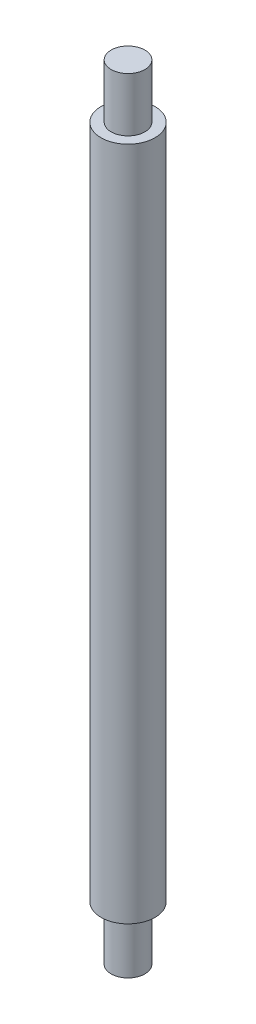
from build123d import *


with BuildPart() as part:
    # Sketch1 → Revolve1 (revolve)
    with BuildSketch(Plane.XY, mode=Mode.PRIVATE) as revolve1_sk:
        Polygon((0, -58), (0, 58), (2.5, 58), (2.5, 50), (4, 50), (4, -50), (2.5, -50), (2.5, -58), align=None)
    revolve(revolve1_sk.sketch.rotate(Axis((0, -58, 0), (0, 1, 0)), 90), axis=Axis((0, -58, 0), (0, 1, 0)))


solid = part.part
